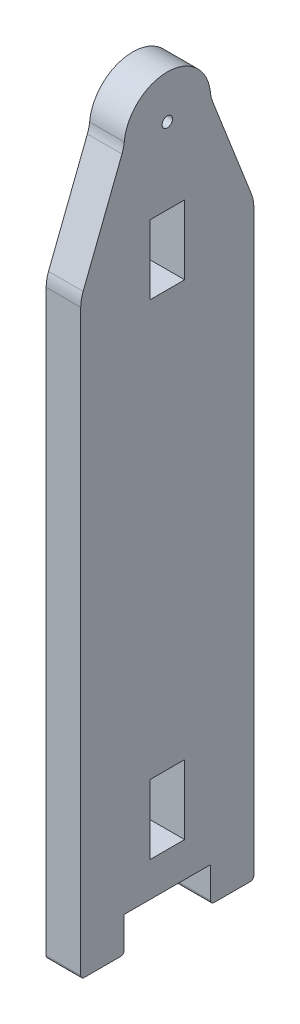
from build123d import *

# Parameters (mm, degrees)
SKETCH2_R           = 3
SKETCH2_W           = 20
SKETCH2_H           = 40
BOSS_EXTRUDE2_DEPTH = 20
FILLET1_R           = 20
FILLET2_R           = 2


with BuildPart() as part:
    # Sketch2 → Boss-Extrude2 (new body)
    with BuildSketch(Plane(origin=(0, 0, 0), x_dir=(0, 0, -1), z_dir=(1, 0, 0))):
        with BuildLine():
            Line((0, 0), (25, 0))
            Line((25, 0), (25, -20))
            Line((25, -20), (50, -20))
            Line((50, -20), (50, 320))
            Line((50, 320), (25, 384))
            ThreePointArc((25, 384), (0, 409), (-25, 384))
            Line((-25, 384), (-50, 320))
            Line((-50, 320), (-50, -20))
            Line((-50, -20), (-25, -20))
            Line((-25, -20), (-25, 0))
            Line((-25, 0), (0, 0))
        make_face()
        with Locations((0, 384)):
            Circle(SKETCH2_R, mode=Mode.SUBTRACT)
        with Locations((0, 40)):
            Rectangle(SKETCH2_W, SKETCH2_H, mode=Mode.SUBTRACT)
        with Locations((0, 320)):
            Rectangle(SKETCH2_W, SKETCH2_H, mode=Mode.SUBTRACT)
    extrude(amount=BOSS_EXTRUDE2_DEPTH)

    # Fillet1
    fillet1_edges = [part.edges().sort_by_distance(p)[0] for p in [
        (10, 320, 50),
        (10, 384, 25),
        (10, 384, -25),
        (10, 320, -50),
    ]]
    fillet(fillet1_edges, radius=FILLET1_R)

    # Fillet2
    fillet2_edges = [part.edges().sort_by_distance(p)[0] for p in [
        (10, -20, 25),
        (10, -20, 50),
        (10, -20, -50),
        (10, -20, -25),
    ]]
    fillet(fillet2_edges, radius=FILLET2_R)


solid = part.part
